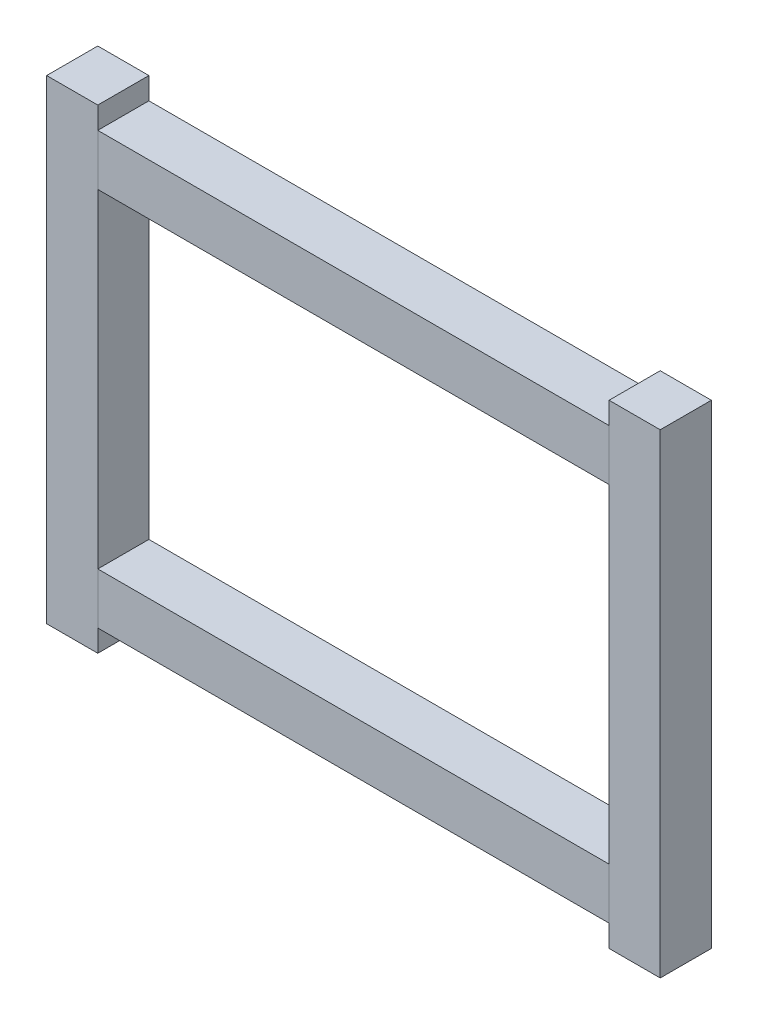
from build123d import *

# Parameters (mm, degrees)
ESQUISSE1_W        = 14
ESQUISSE1_H        = 130
BOSS_EXTRU_1_DEPTH = 14
ESQUISSE2_W        = 140
ESQUISSE2_H        = 14
BOSS_EXTRU_2_DEPTH = 14
ESQUISSE3_W        = 14
ESQUISSE3_H        = 14
BOSS_EXTRU_3_DEPTH = 130
BOSS_EXTRU_4_REACH = 200.212
ESQUISSE4_W        = 14
ESQUISSE4_H        = 14


with BuildPart() as part:
    # Esquisse1 → Boss.-Extru.1 (new body)
    with BuildSketch(Plane.XY):
        with Locations((-7, 59)):
            Rectangle(ESQUISSE1_W, ESQUISSE1_H)
    extrude(amount=BOSS_EXTRU_1_DEPTH)


with BuildPart() as body_2:
    # Esquisse2 → Boss.-Extru.2 (new body)
    with BuildSketch(Plane.XY):
        with Locations((70, 7)):
            Rectangle(ESQUISSE2_W, ESQUISSE2_H)
    extrude(amount=BOSS_EXTRU_2_DEPTH)


with BuildPart() as body_3:
    # Esquisse3 → Boss.-Extru.3 (new body)
    with BuildSketch(Plane.XZ.offset(6)):
        with Locations((147, 7)):
            Rectangle(ESQUISSE3_W, ESQUISSE3_H)
    extrude(amount=-BOSS_EXTRU_3_DEPTH)


with BuildPart() as body_4:

    # Esquisse4 → Boss.-Extru.4 (new, up to next)
    with BuildSketch(Plane(origin=(0, 0, 0), x_dir=(0, 0, -1), z_dir=(1, 0, 0)), mode=Mode.PRIVATE) as boss_extru_4_sk1:
        with Locations((-7, 111)):
            Rectangle(ESQUISSE4_W, ESQUISSE4_H)
    boss_extru_4_tool1 = extrude(boss_extru_4_sk1.sketch, amount=BOSS_EXTRU_4_REACH, mode=Mode.PRIVATE) - body_3.part
    add(boss_extru_4_tool1.solids().sort_by_distance((0, 111, 7))[0])


solid = Compound([part.part, body_2.part, body_3.part, body_4.part])
